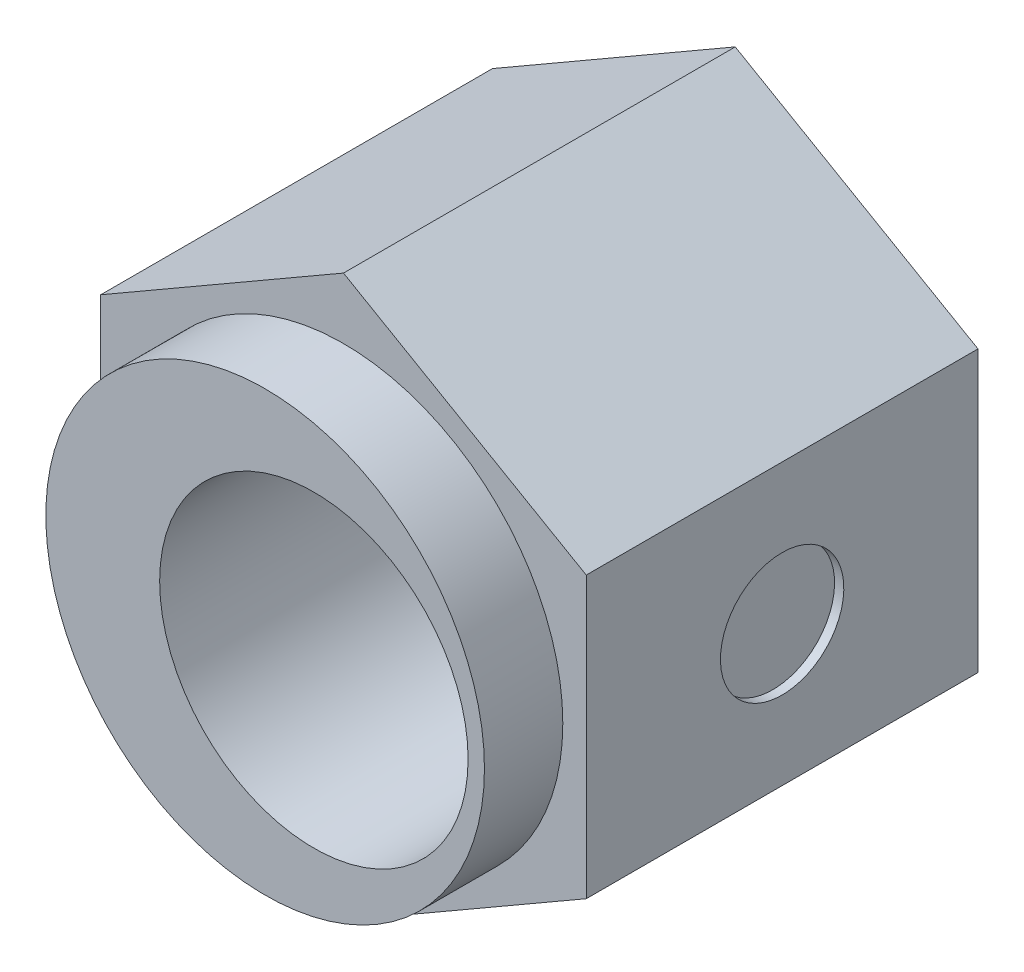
ISO-10303-21;
HEADER;
FILE_DESCRIPTION(('STEP AP214'),'2;1');
FILE_NAME('part.step','',(''),(''),'','','');
FILE_SCHEMA(('AUTOMOTIVE_DESIGN { 1 0 10303 214 1 1 1 1 }'));
ENDSEC;
DATA;
#1=APPLICATION_CONTEXT('core data for automotive mechanical design processes');
#2=APPLICATION_PROTOCOL_DEFINITION('international standard','automotive_design',2000,#1);
#3=PRODUCT_CONTEXT('',#1,'mechanical');
#4=PRODUCT('Part','Part','',(#3));
#5=PRODUCT_RELATED_PRODUCT_CATEGORY('part','',(#4));
#6=PRODUCT_DEFINITION_FORMATION('','',#4);
#7=PRODUCT_DEFINITION_CONTEXT('part definition',#1,'design');
#8=PRODUCT_DEFINITION('design','',#6,#7);
#9=PRODUCT_DEFINITION_SHAPE('','',#8);
#10=(LENGTH_UNIT() NAMED_UNIT(*) SI_UNIT(.MILLI.,.METRE.));
#11=(NAMED_UNIT(*) PLANE_ANGLE_UNIT() SI_UNIT($,.RADIAN.));
#12=(NAMED_UNIT(*) SI_UNIT($,.STERADIAN.) SOLID_ANGLE_UNIT());
#13=UNCERTAINTY_MEASURE_WITH_UNIT(LENGTH_MEASURE(1.E-05),#10,'distance_accuracy_value','');
#14=(GEOMETRIC_REPRESENTATION_CONTEXT(3) GLOBAL_UNCERTAINTY_ASSIGNED_CONTEXT((#13)) GLOBAL_UNIT_ASSIGNED_CONTEXT((#10,
#11,#12)) REPRESENTATION_CONTEXT('',''));
#15=CARTESIAN_POINT('',(0.,0.,0.));
#16=DIRECTION('',(0.,0.,1.));
#17=DIRECTION('',(1.,0.,0.));
#18=AXIS2_PLACEMENT_3D('',#15,#16,#17);
#19=CARTESIAN_POINT('',(0.,-9.49205006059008,6.35));
#20=DIRECTION('',(0.,0.,1.));
#21=DIRECTION('',(1.,0.,0.));
#22=AXIS2_PLACEMENT_3D('',#19,#20,#21);
#23=PLANE('',#22);
#24=DIRECTION('',(0.,-1.,0.));
#25=VECTOR('',#24,1.);
#26=CARTESIAN_POINT('',(3.93499999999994,-9.49205006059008,6.35));
#27=LINE('',#26,#25);
#28=CARTESIAN_POINT('',(3.93499999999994,2.27187330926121,6.35));
#29=VERTEX_POINT('',#28);
#30=CARTESIAN_POINT('',(3.93499999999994,-2.27187330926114,6.35));
#31=VERTEX_POINT('',#30);
#32=EDGE_CURVE('E132',#29,#31,#27,.T.);
#33=ORIENTED_EDGE('',*,*,#32,.F.);
#34=DIRECTION('',(0.866025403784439,-0.5,0.));
#35=VECTOR('',#34,1.);
#36=CARTESIAN_POINT('',(6.07767824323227,1.03479744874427,6.35));
#37=LINE('',#36,#35);
#38=CARTESIAN_POINT('',(0.,4.54374661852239,6.35));
#39=VERTEX_POINT('',#38);
#40=EDGE_CURVE('E197',#39,#29,#37,.T.);
#41=ORIENTED_EDGE('',*,*,#40,.F.);
#42=DIRECTION('',(0.866025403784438,0.5,0.));
#43=VECTOR('',#42,1.);
#44=CARTESIAN_POINT('',(-6.07767824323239,1.03479744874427,6.35));
#45=LINE('',#44,#43);
#46=CARTESIAN_POINT('',(-3.93500000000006,2.27187330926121,6.35));
#47=VERTEX_POINT('',#46);
#48=EDGE_CURVE('E106',#47,#39,#45,.T.);
#49=ORIENTED_EDGE('',*,*,#48,.F.);
#50=DIRECTION('',(0.,1.,0.));
#51=VECTOR('',#50,1.);
#52=CARTESIAN_POINT('',(-3.93500000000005,-9.49205006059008,6.35));
#53=LINE('',#52,#51);
#54=CARTESIAN_POINT('',(-3.93500000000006,-2.27187330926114,6.35));
#55=VERTEX_POINT('',#54);
#56=EDGE_CURVE('E90',#55,#47,#53,.T.);
#57=ORIENTED_EDGE('',*,*,#56,.F.);
#58=DIRECTION('',(-0.866025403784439,0.5,0.));
#59=VECTOR('',#58,1.);
#60=CARTESIAN_POINT('',(2.14267824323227,-5.78082247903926,6.35));
#61=LINE('',#60,#59);
#62=CARTESIAN_POINT('',(0.,-4.54374661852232,6.35));
#63=VERTEX_POINT('',#62);
#64=EDGE_CURVE('E103',#63,#55,#61,.T.);
#65=ORIENTED_EDGE('',*,*,#64,.F.);
#66=DIRECTION('',(-0.866025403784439,-0.5,0.));
#67=VECTOR('',#66,1.);
#68=CARTESIAN_POINT('',(-2.14267824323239,-5.78082247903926,6.35));
#69=LINE('',#68,#67);
#70=EDGE_CURVE('E109',#31,#63,#69,.T.);
#71=ORIENTED_EDGE('',*,*,#70,.F.);
#72=EDGE_LOOP('',(#33,#41,#49,#57,#65,#71));
#73=FACE_BOUND('',#72,.T.);
#74=CARTESIAN_POINT('',(0.,0.,6.35));
#75=DIRECTION('',(0.,0.,1.));
#76=DIRECTION('',(1.,0.,0.));
#77=AXIS2_PLACEMENT_3D('',#74,#75,#76);
#78=CIRCLE('',#77,3.555);
#79=CARTESIAN_POINT('',(3.555,0.,6.35));
#80=VERTEX_POINT('',#79);
#81=EDGE_CURVE('E183',#80,#80,#78,.T.);
#82=ORIENTED_EDGE('',*,*,#81,.F.);
#83=EDGE_LOOP('',(#82));
#84=FACE_BOUND('',#83,.T.);
#85=ADVANCED_FACE('F32',(#73,#84),#23,.T.);
#86=CARTESIAN_POINT('',(3.93499999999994,-9.49205006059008,6.35));
#87=DIRECTION('',(1.,0.,0.));
#88=DIRECTION('',(0.,1.,0.));
#89=AXIS2_PLACEMENT_3D('',#86,#87,#88);
#90=PLANE('',#89);
#91=CARTESIAN_POINT('',(3.93499999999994,0.,3.175));
#92=DIRECTION('',(1.,0.,0.));
#93=DIRECTION('',(0.,1.,0.));
#94=AXIS2_PLACEMENT_3D('',#91,#92,#93);
#95=CIRCLE('',#94,1.);
#96=CARTESIAN_POINT('',(3.93499999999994,0.999999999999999,3.175));
#97=VERTEX_POINT('',#96);
#98=EDGE_CURVE('E184',#97,#97,#95,.T.);
#99=ORIENTED_EDGE('',*,*,#98,.F.);
#100=EDGE_LOOP('',(#99));
#101=FACE_BOUND('',#100,.T.);
#102=DIRECTION('',(0.,-1.,0.));
#103=VECTOR('',#102,1.);
#104=CARTESIAN_POINT('',(3.93499999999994,-9.49205006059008,0.));
#105=LINE('',#104,#103);
#106=CARTESIAN_POINT('',(3.93499999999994,2.27187330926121,0.));
#107=VERTEX_POINT('',#106);
#108=CARTESIAN_POINT('',(3.93499999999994,-2.27187330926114,0.));
#109=VERTEX_POINT('',#108);
#110=EDGE_CURVE('E117',#107,#109,#105,.T.);
#111=ORIENTED_EDGE('',*,*,#110,.F.);
#112=DIRECTION('',(0.,0.,-1.));
#113=VECTOR('',#112,1.);
#114=CARTESIAN_POINT('',(3.93499999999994,2.27187330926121,6.35));
#115=LINE('',#114,#113);
#116=EDGE_CURVE('E11',#29,#107,#115,.T.);
#117=ORIENTED_EDGE('',*,*,#116,.F.);
#118=ORIENTED_EDGE('',*,*,#32,.T.);
#119=DIRECTION('',(0.,0.,-1.));
#120=VECTOR('',#119,1.);
#121=CARTESIAN_POINT('',(3.93499999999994,-2.27187330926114,6.35));
#122=LINE('',#121,#120);
#123=EDGE_CURVE('E49',#31,#109,#122,.T.);
#124=ORIENTED_EDGE('',*,*,#123,.T.);
#125=EDGE_LOOP('',(#111,#117,#118,#124));
#126=FACE_BOUND('',#125,.T.);
#127=ADVANCED_FACE('F157',(#101,#126),#90,.T.);
#128=CARTESIAN_POINT('',(6.07767824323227,1.03479744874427,6.35));
#129=DIRECTION('',(0.5,0.866025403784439,0.));
#130=DIRECTION('',(-0.866025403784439,0.5,0.));
#131=AXIS2_PLACEMENT_3D('',#128,#129,#130);
#132=PLANE('',#131);
#133=DIRECTION('',(0.866025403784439,-0.5,0.));
#134=VECTOR('',#133,1.);
#135=CARTESIAN_POINT('',(6.07767824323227,1.03479744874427,0.));
#136=LINE('',#135,#134);
#137=CARTESIAN_POINT('',(0.,4.54374661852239,0.));
#138=VERTEX_POINT('',#137);
#139=EDGE_CURVE('E120',#138,#107,#136,.T.);
#140=ORIENTED_EDGE('',*,*,#139,.F.);
#141=DIRECTION('',(0.,0.,-1.));
#142=VECTOR('',#141,1.);
#143=CARTESIAN_POINT('',(0.,4.54374661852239,6.35));
#144=LINE('',#143,#142);
#145=EDGE_CURVE('E41',#39,#138,#144,.T.);
#146=ORIENTED_EDGE('',*,*,#145,.F.);
#147=ORIENTED_EDGE('',*,*,#40,.T.);
#148=ORIENTED_EDGE('',*,*,#116,.T.);
#149=EDGE_LOOP('',(#140,#146,#147,#148));
#150=FACE_BOUND('',#149,.T.);
#151=ADVANCED_FACE('F141',(#150),#132,.T.);
#152=CARTESIAN_POINT('',(-6.07767824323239,1.03479744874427,6.35));
#153=DIRECTION('',(-0.5,0.866025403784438,0.));
#154=DIRECTION('',(-0.866025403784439,-0.5,0.));
#155=AXIS2_PLACEMENT_3D('',#152,#153,#154);
#156=PLANE('',#155);
#157=DIRECTION('',(0.866025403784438,0.5,0.));
#158=VECTOR('',#157,1.);
#159=CARTESIAN_POINT('',(-6.07767824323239,1.03479744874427,0.));
#160=LINE('',#159,#158);
#161=CARTESIAN_POINT('',(-3.93500000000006,2.27187330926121,0.));
#162=VERTEX_POINT('',#161);
#163=EDGE_CURVE('E123',#162,#138,#160,.T.);
#164=ORIENTED_EDGE('',*,*,#163,.F.);
#165=DIRECTION('',(0.,0.,-1.));
#166=VECTOR('',#165,1.);
#167=CARTESIAN_POINT('',(-3.93500000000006,2.27187330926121,6.35));
#168=LINE('',#167,#166);
#169=EDGE_CURVE('E96',#47,#162,#168,.T.);
#170=ORIENTED_EDGE('',*,*,#169,.F.);
#171=ORIENTED_EDGE('',*,*,#48,.T.);
#172=ORIENTED_EDGE('',*,*,#145,.T.);
#173=EDGE_LOOP('',(#164,#170,#171,#172));
#174=FACE_BOUND('',#173,.T.);
#175=ADVANCED_FACE('F138',(#174),#156,.T.);
#176=CARTESIAN_POINT('',(-3.93500000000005,-9.49205006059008,6.35));
#177=DIRECTION('',(-1.,0.,0.));
#178=DIRECTION('',(0.,-1.,0.));
#179=AXIS2_PLACEMENT_3D('',#176,#177,#178);
#180=PLANE('',#179);
#181=DIRECTION('',(0.,1.,0.));
#182=VECTOR('',#181,1.);
#183=CARTESIAN_POINT('',(-3.93500000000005,-9.49205006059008,0.));
#184=LINE('',#183,#182);
#185=CARTESIAN_POINT('',(-3.93500000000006,-2.27187330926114,0.));
#186=VERTEX_POINT('',#185);
#187=EDGE_CURVE('E92',#186,#162,#184,.T.);
#188=ORIENTED_EDGE('',*,*,#187,.F.);
#189=DIRECTION('',(0.,0.,-1.));
#190=VECTOR('',#189,1.);
#191=CARTESIAN_POINT('',(-3.93500000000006,-2.27187330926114,6.35));
#192=LINE('',#191,#190);
#193=EDGE_CURVE('E87',#55,#186,#192,.T.);
#194=ORIENTED_EDGE('',*,*,#193,.F.);
#195=ORIENTED_EDGE('',*,*,#56,.T.);
#196=ORIENTED_EDGE('',*,*,#169,.T.);
#197=EDGE_LOOP('',(#188,#194,#195,#196));
#198=FACE_BOUND('',#197,.T.);
#199=ADVANCED_FACE('F89',(#198),#180,.T.);
#200=CARTESIAN_POINT('',(2.14267824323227,-5.78082247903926,6.35));
#201=DIRECTION('',(-0.5,-0.866025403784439,0.));
#202=DIRECTION('',(0.866025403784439,-0.5,0.));
#203=AXIS2_PLACEMENT_3D('',#200,#201,#202);
#204=PLANE('',#203);
#205=DIRECTION('',(-0.866025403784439,0.5,0.));
#206=VECTOR('',#205,1.);
#207=CARTESIAN_POINT('',(2.14267824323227,-5.78082247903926,0.));
#208=LINE('',#207,#206);
#209=CARTESIAN_POINT('',(0.,-4.54374661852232,0.));
#210=VERTEX_POINT('',#209);
#211=EDGE_CURVE('E127',#210,#186,#208,.T.);
#212=ORIENTED_EDGE('',*,*,#211,.F.);
#213=DIRECTION('',(0.,0.,-1.));
#214=VECTOR('',#213,1.);
#215=CARTESIAN_POINT('',(0.,-4.54374661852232,6.35));
#216=LINE('',#215,#214);
#217=EDGE_CURVE('E68',#63,#210,#216,.T.);
#218=ORIENTED_EDGE('',*,*,#217,.F.);
#219=ORIENTED_EDGE('',*,*,#64,.T.);
#220=ORIENTED_EDGE('',*,*,#193,.T.);
#221=EDGE_LOOP('',(#212,#218,#219,#220));
#222=FACE_BOUND('',#221,.T.);
#223=ADVANCED_FACE('F108',(#222),#204,.T.);
#224=CARTESIAN_POINT('',(0.79,0.,6.35));
#225=DIRECTION('',(0.,0.,-1.));
#226=DIRECTION('',(-1.,0.,0.));
#227=AXIS2_PLACEMENT_3D('',#224,#225,#226);
#228=CYLINDRICAL_SURFACE('',#227,2.5);
#229=CARTESIAN_POINT('',(0.79,0.,0.));
#230=DIRECTION('',(0.,0.,1.));
#231=DIRECTION('',(1.,0.,0.));
#232=AXIS2_PLACEMENT_3D('',#229,#230,#231);
#233=CIRCLE('',#232,2.5);
#234=CARTESIAN_POINT('',(-1.71,0.,0.));
#235=VERTEX_POINT('',#234);
#236=EDGE_CURVE('E114',#235,#235,#233,.T.);
#237=CARTESIAN_POINT('',(0.79,0.,7.62));
#238=DIRECTION('',(0.,0.,1.));
#239=DIRECTION('',(1.,0.,0.));
#240=AXIS2_PLACEMENT_3D('',#237,#238,#239);
#241=CIRCLE('',#240,2.5);
#242=CARTESIAN_POINT('',(-1.71,0.,7.62));
#243=VERTEX_POINT('',#242);
#244=EDGE_CURVE('E187',#243,#243,#241,.T.);
#245=CARTESIAN_POINT('',(-1.71,0.,0.));
#246=CARTESIAN_POINT('',(-1.71,0.,0.0793750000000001));
#247=CARTESIAN_POINT('',(-1.71,0.,0.15875));
#248=CARTESIAN_POINT('',(-1.71,0.,0.3175));
#249=CARTESIAN_POINT('',(-1.71,0.,0.396875));
#250=CARTESIAN_POINT('',(-1.71,0.,0.555625));
#251=CARTESIAN_POINT('',(-1.71,0.,0.635));
#252=CARTESIAN_POINT('',(-1.71,0.,0.79375));
#253=CARTESIAN_POINT('',(-1.71,0.,0.873125));
#254=CARTESIAN_POINT('',(-1.71,0.,1.031875));
#255=CARTESIAN_POINT('',(-1.71,0.,1.11125));
#256=CARTESIAN_POINT('',(-1.71,0.,1.27));
#257=CARTESIAN_POINT('',(-1.71,0.,1.349375));
#258=CARTESIAN_POINT('',(-1.71,0.,1.508125));
#259=CARTESIAN_POINT('',(-1.71,0.,1.5875));
#260=CARTESIAN_POINT('',(-1.71,0.,1.74625));
#261=CARTESIAN_POINT('',(-1.71,0.,1.825625));
#262=CARTESIAN_POINT('',(-1.71,0.,1.984375));
#263=CARTESIAN_POINT('',(-1.71,0.,2.06375));
#264=CARTESIAN_POINT('',(-1.71,0.,2.2225));
#265=CARTESIAN_POINT('',(-1.71,0.,2.301875));
#266=CARTESIAN_POINT('',(-1.71,0.,2.460625));
#267=CARTESIAN_POINT('',(-1.71,0.,2.54));
#268=CARTESIAN_POINT('',(-1.71,0.,2.69875));
#269=CARTESIAN_POINT('',(-1.71,0.,2.778125));
#270=CARTESIAN_POINT('',(-1.71,0.,2.936875));
#271=CARTESIAN_POINT('',(-1.71,0.,3.01625));
#272=CARTESIAN_POINT('',(-1.71,0.,3.175));
#273=CARTESIAN_POINT('',(-1.71,0.,3.254375));
#274=CARTESIAN_POINT('',(-1.71,0.,3.413125));
#275=CARTESIAN_POINT('',(-1.71,0.,3.4925));
#276=CARTESIAN_POINT('',(-1.71,0.,3.65125));
#277=CARTESIAN_POINT('',(-1.71,0.,3.730625));
#278=CARTESIAN_POINT('',(-1.71,0.,3.889375));
#279=CARTESIAN_POINT('',(-1.71,0.,3.96875));
#280=CARTESIAN_POINT('',(-1.71,0.,4.1275));
#281=CARTESIAN_POINT('',(-1.71,0.,4.206875));
#282=CARTESIAN_POINT('',(-1.71,0.,4.365625));
#283=CARTESIAN_POINT('',(-1.71,0.,4.445));
#284=CARTESIAN_POINT('',(-1.71,0.,4.60375));
#285=CARTESIAN_POINT('',(-1.71,0.,4.683125));
#286=CARTESIAN_POINT('',(-1.71,0.,4.841875));
#287=CARTESIAN_POINT('',(-1.71,0.,4.92125));
#288=CARTESIAN_POINT('',(-1.71,0.,5.08));
#289=CARTESIAN_POINT('',(-1.71,0.,5.159375));
#290=CARTESIAN_POINT('',(-1.71,0.,5.318125));
#291=CARTESIAN_POINT('',(-1.71,0.,5.3975));
#292=CARTESIAN_POINT('',(-1.71,0.,5.55625));
#293=CARTESIAN_POINT('',(-1.71,0.,5.635625));
#294=CARTESIAN_POINT('',(-1.71,0.,5.794375));
#295=CARTESIAN_POINT('',(-1.71,0.,5.87375));
#296=CARTESIAN_POINT('',(-1.71,0.,6.0325));
#297=CARTESIAN_POINT('',(-1.71,0.,6.111875));
#298=CARTESIAN_POINT('',(-1.71,0.,6.270625));
#299=CARTESIAN_POINT('',(-1.71,0.,6.35));
#300=CARTESIAN_POINT('',(-1.71,0.,6.50875));
#301=CARTESIAN_POINT('',(-1.71,0.,6.588125));
#302=CARTESIAN_POINT('',(-1.71,0.,6.746875));
#303=CARTESIAN_POINT('',(-1.71,0.,6.82625));
#304=CARTESIAN_POINT('',(-1.71,0.,6.985));
#305=CARTESIAN_POINT('',(-1.71,0.,7.064375));
#306=CARTESIAN_POINT('',(-1.71,0.,7.223125));
#307=CARTESIAN_POINT('',(-1.71,0.,7.3025));
#308=CARTESIAN_POINT('',(-1.71,0.,7.46125));
#309=CARTESIAN_POINT('',(-1.71,0.,7.540625));
#310=CARTESIAN_POINT('',(-1.71,0.,7.62));
#311=B_SPLINE_CURVE_WITH_KNOTS('',3,(#245,#246,#247,#248,#249,#250,#251,#252,#253,#254,#255,
#256,#257,#258,#259,#260,#261,#262,#263,#264,#265,#266,#267,#268,#269,#270,#271,#272,#273,#274,
#275,#276,#277,#278,#279,#280,#281,#282,#283,#284,#285,#286,#287,#288,#289,#290,#291,#292,#293,
#294,#295,#296,#297,#298,#299,#300,#301,#302,#303,#304,#305,#306,#307,#308,#309,#310),
.UNSPECIFIED.,.F.,.F.,(4,2,2,2,2,2,2,2,2,2,2,2,2,2,2,2,2,2,2,2,2,2,2,2,2,2,2,2,2,2,2,2,4),(0.,
0.238125,0.47625,0.714375,0.9525,1.190625,1.42875,1.666875,1.905,2.143125,2.38125,2.619375,
2.8575,3.095625,3.33375,3.571875,3.81,4.048125,4.28625,4.524375,4.7625,5.000625,5.23875,
5.476875,5.715,5.953125,6.19125,6.429375,6.6675,6.905625,7.14375,7.381875,7.62),.UNSPECIFIED.);
#312=EDGE_CURVE('BSEAM34',#235,#243,#311,.T.);
#313=ORIENTED_EDGE('',*,*,#236,.F.);
#314=ORIENTED_EDGE('',*,*,#244,.T.);
#315=ORIENTED_EDGE('',*,*,#312,.T.);
#316=ORIENTED_EDGE('',*,*,#312,.F.);
#317=EDGE_LOOP('',(#313,#315,#314,#316));
#318=FACE_BOUND('',#317,.T.);
#319=ADVANCED_FACE('F34',(#318),#228,.F.);
#320=CARTESIAN_POINT('',(-2.14267824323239,-5.78082247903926,6.35));
#321=DIRECTION('',(0.5,-0.866025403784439,0.));
#322=DIRECTION('',(0.866025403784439,0.5,0.));
#323=AXIS2_PLACEMENT_3D('',#320,#321,#322);
#324=PLANE('',#323);
#325=DIRECTION('',(-0.866025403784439,-0.5,0.));
#326=VECTOR('',#325,1.);
#327=CARTESIAN_POINT('',(-2.14267824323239,-5.78082247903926,0.));
#328=LINE('',#327,#326);
#329=EDGE_CURVE('E129',#109,#210,#328,.T.);
#330=ORIENTED_EDGE('',*,*,#329,.F.);
#331=ORIENTED_EDGE('',*,*,#123,.F.);
#332=ORIENTED_EDGE('',*,*,#70,.T.);
#333=ORIENTED_EDGE('',*,*,#217,.T.);
#334=EDGE_LOOP('',(#330,#331,#332,#333));
#335=FACE_BOUND('',#334,.T.);
#336=ADVANCED_FACE('F144',(#335),#324,.T.);
#337=CARTESIAN_POINT('',(0.,-9.49205006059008,0.));
#338=DIRECTION('',(0.,0.,1.));
#339=DIRECTION('',(1.,0.,0.));
#340=AXIS2_PLACEMENT_3D('',#337,#338,#339);
#341=PLANE('',#340);
#342=ORIENTED_EDGE('',*,*,#236,.T.);
#343=EDGE_LOOP('',(#342));
#344=FACE_BOUND('',#343,.T.);
#345=ORIENTED_EDGE('',*,*,#110,.T.);
#346=ORIENTED_EDGE('',*,*,#329,.T.);
#347=ORIENTED_EDGE('',*,*,#211,.T.);
#348=ORIENTED_EDGE('',*,*,#187,.T.);
#349=ORIENTED_EDGE('',*,*,#163,.T.);
#350=ORIENTED_EDGE('',*,*,#139,.T.);
#351=EDGE_LOOP('',(#345,#346,#347,#348,#349,#350));
#352=FACE_BOUND('',#351,.T.);
#353=ADVANCED_FACE('F143',(#344,#352),#341,.F.);
#354=CARTESIAN_POINT('',(0.,0.,7.62));
#355=DIRECTION('',(0.,0.,-1.));
#356=DIRECTION('',(-1.,0.,0.));
#357=AXIS2_PLACEMENT_3D('',#354,#355,#356);
#358=CYLINDRICAL_SURFACE('',#357,3.555);
#359=CARTESIAN_POINT('',(0.,0.,7.62));
#360=DIRECTION('',(0.,0.,1.));
#361=DIRECTION('',(1.,0.,0.));
#362=AXIS2_PLACEMENT_3D('',#359,#360,#361);
#363=CIRCLE('',#362,3.555);
#364=CARTESIAN_POINT('',(3.555,0.,7.62));
#365=VERTEX_POINT('',#364);
#366=EDGE_CURVE('E118',#365,#365,#363,.T.);
#367=ORIENTED_EDGE('',*,*,#366,.F.);
#368=EDGE_LOOP('',(#367));
#369=FACE_BOUND('',#368,.T.);
#370=ORIENTED_EDGE('',*,*,#81,.T.);
#371=EDGE_LOOP('',(#370));
#372=FACE_BOUND('',#371,.T.);
#373=ADVANCED_FACE('F151',(#369,#372),#358,.T.);
#374=CARTESIAN_POINT('',(0.,-7.96242135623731,7.62));
#375=DIRECTION('',(0.,0.,1.));
#376=DIRECTION('',(1.,0.,0.));
#377=AXIS2_PLACEMENT_3D('',#374,#375,#376);
#378=PLANE('',#377);
#379=ORIENTED_EDGE('',*,*,#244,.F.);
#380=EDGE_LOOP('',(#379));
#381=FACE_BOUND('',#380,.T.);
#382=ORIENTED_EDGE('',*,*,#366,.T.);
#383=EDGE_LOOP('',(#382));
#384=FACE_BOUND('',#383,.T.);
#385=ADVANCED_FACE('F166',(#381,#384),#378,.T.);
#386=CARTESIAN_POINT('',(3.78499999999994,0.,3.175));
#387=DIRECTION('',(1.,0.,0.));
#388=DIRECTION('',(0.,1.,0.));
#389=AXIS2_PLACEMENT_3D('',#386,#387,#388);
#390=CYLINDRICAL_SURFACE('',#389,1.);
#391=CARTESIAN_POINT('',(3.78499999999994,0.,3.175));
#392=DIRECTION('',(1.,0.,0.));
#393=DIRECTION('',(0.,1.,0.));
#394=AXIS2_PLACEMENT_3D('',#391,#392,#393);
#395=CIRCLE('',#394,1.);
#396=CARTESIAN_POINT('',(3.78499999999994,0.999999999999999,3.175));
#397=VERTEX_POINT('',#396);
#398=EDGE_CURVE('E182',#397,#397,#395,.T.);
#399=ORIENTED_EDGE('',*,*,#398,.F.);
#400=EDGE_LOOP('',(#399));
#401=FACE_BOUND('',#400,.T.);
#402=ORIENTED_EDGE('',*,*,#98,.T.);
#403=EDGE_LOOP('',(#402));
#404=FACE_BOUND('',#403,.T.);
#405=ADVANCED_FACE('F170',(#401,#404),#390,.F.);
#406=CARTESIAN_POINT('',(3.78499999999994,0.,3.175));
#407=DIRECTION('',(1.,0.,0.));
#408=DIRECTION('',(0.,1.,0.));
#409=AXIS2_PLACEMENT_3D('',#406,#407,#408);
#410=PLANE('',#409);
#411=ORIENTED_EDGE('',*,*,#398,.T.);
#412=EDGE_LOOP('',(#411));
#413=FACE_BOUND('',#412,.T.);
#414=ADVANCED_FACE('F174',(#413),#410,.T.);
#415=CLOSED_SHELL('',(#85,#127,#151,#175,#199,#223,#319,#336,#353,#373,#385,#405,#414));
#416=MANIFOLD_SOLID_BREP('B2',#415);
#417=ADVANCED_BREP_SHAPE_REPRESENTATION('',(#18,#416),#14);
#418=SHAPE_DEFINITION_REPRESENTATION(#9,#417);
ENDSEC;
END-ISO-10303-21;
